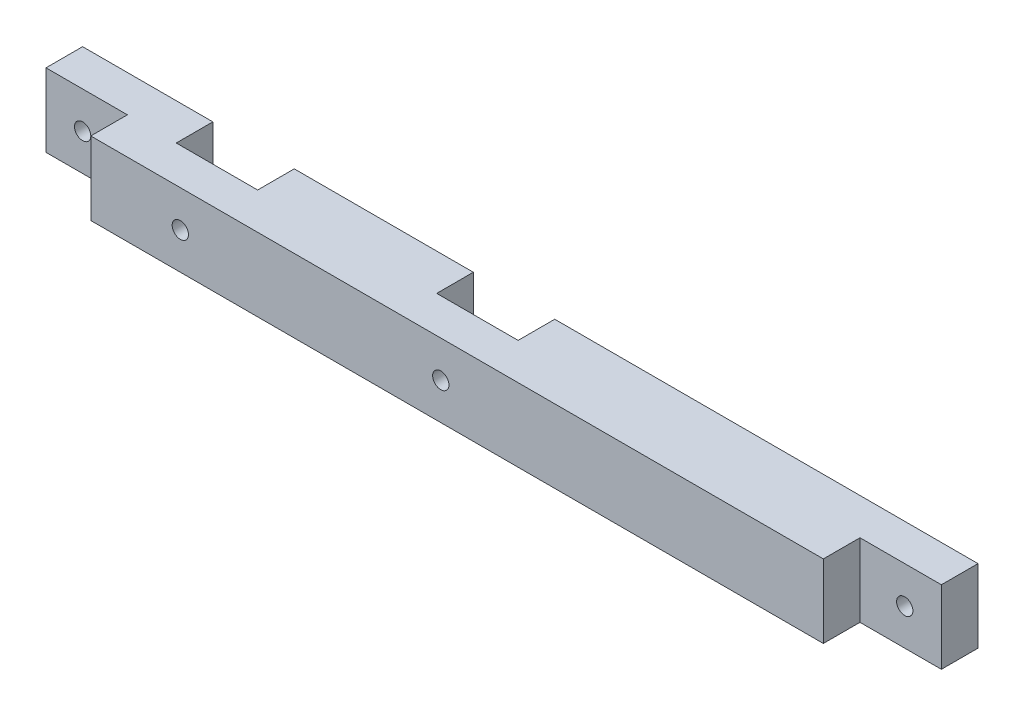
from build123d import *

# Parameters (mm, degrees)
ESQUISSE1_W             = 110
ESQUISSE1_H             = 9
EXTRUSION1_DEPTH        = 9
ESQUISSE2_W             = 10
ESQUISSE2_H             = 9
ENL_V_MAT_EXTRU_1_DEPTH = 4.5
ESQUISSE4_R             = 1
ENL_V_MAT_EXTRU_2_DEPTH = 4.5
ESQUISSE5_R             = 1
ENL_V_MAT_EXTRU_3_DEPTH = 4.5
ESQUISSE6_W             = 10
ESQUISSE6_H             = 9
ENL_V_MAT_EXTRU_4_DEPTH = 4.5
ESQUISSE7_R             = 1
ENL_V_MAT_EXTRU_5_DEPTH = 4.5
ESQUISSE8_R             = 1
ENL_V_MAT_EXTRU_6_DEPTH = 4.5


with BuildPart() as part:
    # Esquisse1 → Extrusion1 (new body)
    with BuildSketch(Plane.XY):
        with Locations((-12.271684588, -105.117562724)):
            Rectangle(ESQUISSE1_W, ESQUISSE1_H)
    extrude(amount=EXTRUSION1_DEPTH)

    # Esquisse2 → Enl_v. mat.-Extru.1 (cut)
    with BuildSketch(Plane.XY.offset(9)):
        with Locations((-62.271684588, -105.117562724)):
            Rectangle(ESQUISSE2_W, ESQUISSE2_H)
        with Locations((37.728315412, -105.117562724)):
            Rectangle(ESQUISSE2_W, ESQUISSE2_H)
    extrude(amount=-ENL_V_MAT_EXTRU_1_DEPTH, mode=Mode.SUBTRACT)

    # Esquisse4 → Enl_v. mat.-Extru.2 (cut)
    with BuildSketch(Plane.XY.offset(4.5)):
        with Locations((38.22840174, -105.145436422)):
            Circle(ESQUISSE4_R)
    extrude(amount=-ENL_V_MAT_EXTRU_2_DEPTH, mode=Mode.SUBTRACT)

    # Esquisse5 → Enl_v. mat.-Extru.3 (cut)
    with BuildSketch(Plane.XY.offset(4.5)):
        with Locations((-62.771684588, -105.117562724)):
            Circle(ESQUISSE5_R)
    extrude(amount=-ENL_V_MAT_EXTRU_3_DEPTH, mode=Mode.SUBTRACT)

    # Esquisse6 → Enl_v. mat.-Extru.4 (cut)
    with BuildSketch(Plane(origin=(0, 0, 0), x_dir=(-1, 0, 0), z_dir=(0, 0, -1))):
        with Locations((46.271684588, -105.117562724)):
            Rectangle(ESQUISSE6_W, ESQUISSE6_H)
        with Locations((14.271684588, -105.117562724)):
            Rectangle(ESQUISSE6_W, ESQUISSE6_H)
    extrude(amount=-ENL_V_MAT_EXTRU_4_DEPTH, mode=Mode.SUBTRACT)

    # Esquisse7 → Enl_v. mat.-Extru.5 (cut)
    with BuildSketch(Plane(origin=(0, 0, 4.5), x_dir=(-1, 0, 0), z_dir=(0, 0, -1))):
        with Locations((14.271684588, -105.117562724)):
            Circle(ESQUISSE7_R)
    extrude(amount=-ENL_V_MAT_EXTRU_5_DEPTH, mode=Mode.SUBTRACT)

    # Esquisse8 → Enl_v. mat.-Extru.6 (cut)
    with BuildSketch(Plane(origin=(0, 0, 4.5), x_dir=(-1, 0, 0), z_dir=(0, 0, -1))):
        with Locations((46.271684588, -105.117562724)):
            Circle(ESQUISSE8_R)
    extrude(amount=-ENL_V_MAT_EXTRU_6_DEPTH, mode=Mode.SUBTRACT)


solid = part.part
